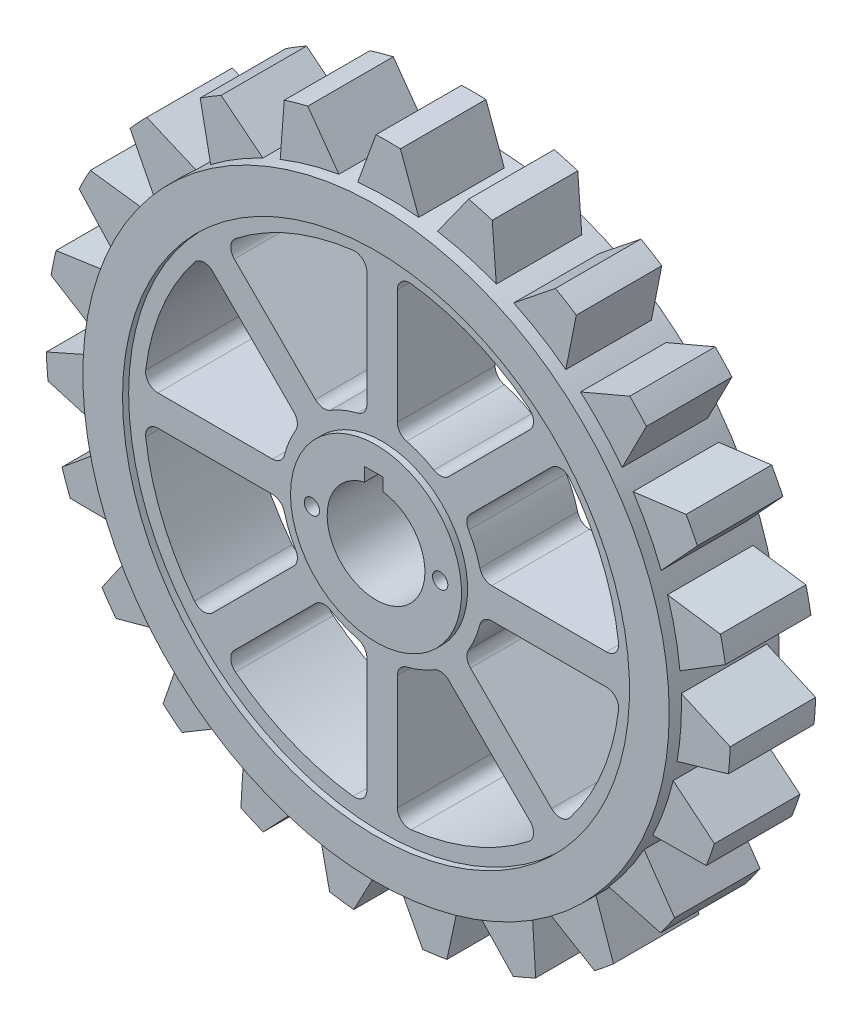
from build123d import *

# Parameters (mm, degrees)
SKETCH2_R                = 48
BOSS_EXTRUDE1_DEPTH      = 9
CUT_EXTRUDE1_DEPTH       = 71.228199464
SKETCH7_R                = 41.5
SKETCH7_R_2              = 14
CUT_EXTRUDE3_DEPTH       = 1
CUT_EXTRUDE4_DEPTH       = 70.978568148
FILLET1_R                = 2
CIRPATTERN2_COUNT        = 8
FILLET1_OF_CIRPATTERN2_R = 2
BOSS_EXTRUDE2_DEPTH      = 7
CIRPATTERN3_COUNT        = 23
CUT_EXTRUDE5_DEPTH       = 80.684840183
CUT_EXTRUDE5_DEPTH_BACK  = 80.684840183
SKETCH10_R               = 1.25


with BuildPart() as part:
    # Sketch2 → Boss-Extrude1 (new, symmetric)
    with BuildSketch(Plane.XY):
        Circle(SKETCH2_R)
    extrude(amount=BOSS_EXTRUDE1_DEPTH, both=True)

    # Sketch3 → Cut-Extrude1 (cut, through all)
    with BuildSketch(Plane.XY.offset(9)):
        with BuildLine():
            Line((-1.882722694, 10), (-1.882722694, 7.775304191))
            ThreePointArc((-1.882722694, 7.775304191), (0.389649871, -7.990505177), (1.117277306, 7.92159652))
            Line((1.117277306, 7.92159652), (1.117277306, 10))
            Line((1.117277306, 10), (-1.882722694, 10))
        make_face()
    extrude(amount=-CUT_EXTRUDE1_DEPTH, mode=Mode.SUBTRACT)

    # Sketch7 → Cut-Extrude3 (cut)
    with BuildSketch(Plane(origin=(0, 0, -9), x_dir=(-1, 0, 0), z_dir=(0, 0, -1))):
        Circle(SKETCH7_R)
        Circle(SKETCH7_R_2, mode=Mode.SUBTRACT)
    cut_extrude3 = extrude(amount=-CUT_EXTRUDE3_DEPTH, mode=Mode.SUBTRACT)

    # Mirror2: Cut-Extrude3 across plane
    add(cut_extrude3.mirror(Plane.XY), mode=Mode.SUBTRACT)

    # Sketch8 → Cut-Extrude4 (cut, through all)
    with BuildSketch(Plane(origin=(0, 0, -8), x_dir=(-1, 0, 0), z_dir=(0, 0, -1))):
        with BuildLine():
            ThreePointArc((25.752679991, 29.288213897), (14.924653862, 36.031301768), (2.5, 38.919789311))
            Line((2.5, 38.919789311), (2.5, 16.30950643))
            ThreePointArc((2.5, 16.30950643), (6.314276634, 15.244012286), (9.764795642, 13.300329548))
            Line((9.764795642, 13.300329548), (25.752679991, 29.288213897))
        make_face()
    cut_extrude4 = extrude(amount=-CUT_EXTRUDE4_DEPTH, mode=Mode.SUBTRACT)

    # Fillet1
    fillet1_edges = [part.edges().sort_by_distance(p)[0] for p in [
        (-25.752679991, 29.288213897, 0),
        (-9.764795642, 13.300329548, 0),
        (-2.5, 16.30950643, 0),
        (-2.5, 38.919789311, 0),
    ]]
    fillet(fillet1_edges, radius=FILLET1_R)

    # CirPattern2: Cut-Extrude4 ×8 about axis
    cirpattern2_axis = Axis((0, 0, 0), (0, 0, 1))
    for i in range(1, CIRPATTERN2_COUNT):
        add(cut_extrude4.rotate(cirpattern2_axis, i * 360 / CIRPATTERN2_COUNT), mode=Mode.SUBTRACT)

    # Fillet1 of CirPattern2
    fillet1_of_cirpattern2_edges = [part.edges().sort_by_distance(p)[0] for p in [
        (-38.919789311, 2.5, 0),
        (-16.30950643, 2.5, 0),
        (-13.300329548, 9.764795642, 0),
        (-29.288213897, 25.752679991, 0),
        (-29.288213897, -25.752679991, 0),
        (-13.300329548, -9.764795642, 0),
        (-16.30950643, -2.5, 0),
        (-38.919789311, -2.5, 0),
        (-2.5, -38.919789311, 0),
        (-2.5, -16.30950643, 0),
        (-9.764795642, -13.300329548, 0),
        (-25.752679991, -29.288213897, 0),
        (25.752679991, -29.288213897, 0),
        (9.764795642, -13.300329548, 0),
        (2.5, -16.30950643, 0),
        (2.5, -38.919789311, 0),
        (38.919789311, -2.5, 0),
        (16.30950643, -2.5, 0),
        (13.300329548, -9.764795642, 0),
        (29.288213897, -25.752679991, 0),
        (29.288213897, 25.752679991, 0),
        (13.300329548, 9.764795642, 0),
        (16.30950643, 2.5, 0),
        (38.919789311, 2.5, 0),
        (2.5, 38.919789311, 0),
        (2.5, 16.30950643, 0),
        (9.764795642, 13.300329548, 0),
        (25.752679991, 29.288213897, 0),
    ]]
    fillet(fillet1_of_cirpattern2_edges, radius=FILLET1_OF_CIRPATTERN2_R)

    # Sketch9 → Boss-Extrude2 (add, symmetric)
    with BuildSketch(Plane.XY):
        with BuildLine():
            Line((-2, 55.964274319), (-4.993555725, 47.73954756))
            ThreePointArc((-4.993555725, 47.73954756), (0, 48), (4.993555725, 47.73954756))
            Line((4.993555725, 47.73954756), (2, 55.964274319))
            ThreePointArc((2, 55.964274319), (0, 56), (-2, 55.964274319))
        make_face()
    boss_extrude2 = extrude(amount=BOSS_EXTRUDE2_DEPTH, both=True)

    # CirPattern3: Boss-Extrude2 ×23 about axis
    cirpattern3_axis = Axis((0, 0, 0), (0, 0, 1))
    for i in range(1, CIRPATTERN3_COUNT):
        add(boss_extrude2.rotate(cirpattern3_axis, i * 360 / CIRPATTERN3_COUNT))

    # Sketch10 → Cut-Extrude5 (cut, two sides: drawn at the far end of the back side and taken through both)
    with BuildSketch(Plane.XY.offset(-CUT_EXTRUDE5_DEPTH_BACK)):
        with Locations((-10.5, 0)):
            Circle(SKETCH10_R)
        with Locations((10.5, 0)):
            Circle(SKETCH10_R)
    extrude(amount=CUT_EXTRUDE5_DEPTH + CUT_EXTRUDE5_DEPTH_BACK, mode=Mode.SUBTRACT)


solid = part.part
